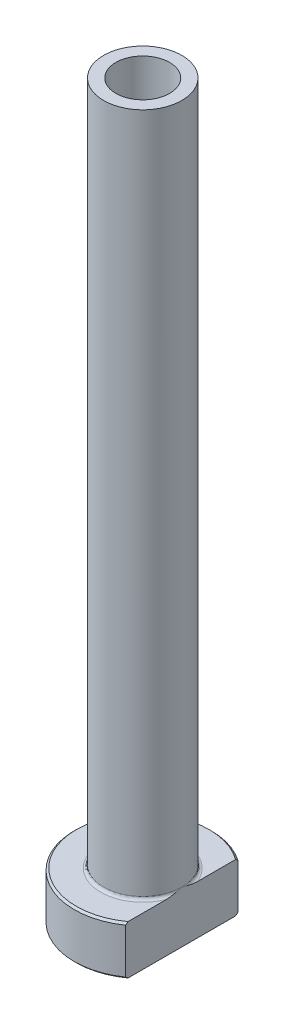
from build123d import *

# Parameters (mm, degrees)
FILLET1_R          = 0.3
CHAMFER1_SIZE      = 0.2
CUT_EXTRUDE1_DEPTH = 76.650512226
CHAMFER2_SIZE      = 0.5


with BuildPart() as part:
    # Sketch1 → Revolve1 (revolve)
    with BuildSketch(Plane.XY, mode=Mode.PRIVATE) as revolve1_sk:
        Polygon((-2.75, 75), (-4, 75), (-4, 5), (-7, 5), (-7, 0), (-3, 0), (-3, 18), (-2.75, 30), align=None)
    revolve(revolve1_sk.sketch.rotate(Axis((0, 92.187680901, 0), (0, -1, 0)), 270), axis=Axis((0, 92.187680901, 0), (0, -1, 0)))

    # Fillet1
    fillet1_edges = [part.edges().sort_by_distance(p)[0] for p in [
        (0, 5, -4),
    ]]
    fillet(fillet1_edges, radius=FILLET1_R)

    # Chamfer1
    chamfer1_edges = [part.edges().sort_by_distance(p)[0] for p in [
        (0, 0, -7),
        (0, 5, -7),
    ]]
    chamfer(chamfer1_edges, length=CHAMFER1_SIZE)

    # Sketch2 → Cut-Extrude1 (cut, through all)
    with BuildSketch(Plane.XZ):
        with BuildLine():
            Line((4, 5.744562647), (4, -5.744562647))
            ThreePointArc((4, -5.744562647), (7, 0), (4, 5.744562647))
        make_face()
    extrude(amount=-CUT_EXTRUDE1_DEPTH, mode=Mode.SUBTRACT)

    # Chamfer2
    chamfer2_edges = [part.edges().sort_by_distance(p)[0] for p in [
        (0, 0, -3),
    ]]
    chamfer(chamfer2_edges, length=CHAMFER2_SIZE)


solid = part.part
